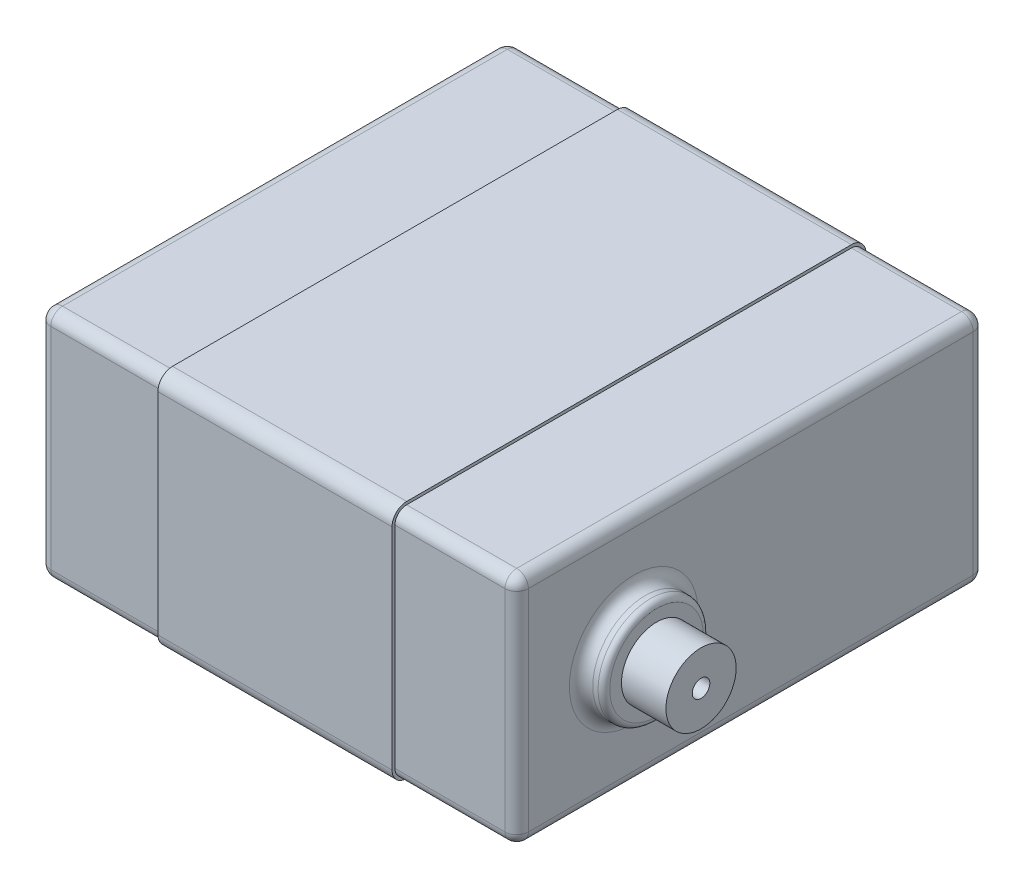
ISO-10303-21;
HEADER;
FILE_DESCRIPTION(('STEP AP214'),'2;1');
FILE_NAME('part.step','',(''),(''),'','','');
FILE_SCHEMA(('AUTOMOTIVE_DESIGN { 1 0 10303 214 1 1 1 1 }'));
ENDSEC;
DATA;
#1=APPLICATION_CONTEXT('core data for automotive mechanical design processes');
#2=APPLICATION_PROTOCOL_DEFINITION('international standard','automotive_design',2000,#1);
#3=PRODUCT_CONTEXT('',#1,'mechanical');
#4=PRODUCT('Part','Part','',(#3));
#5=PRODUCT_RELATED_PRODUCT_CATEGORY('part','',(#4));
#6=PRODUCT_DEFINITION_FORMATION('','',#4);
#7=PRODUCT_DEFINITION_CONTEXT('part definition',#1,'design');
#8=PRODUCT_DEFINITION('design','',#6,#7);
#9=PRODUCT_DEFINITION_SHAPE('','',#8);
#10=(LENGTH_UNIT() NAMED_UNIT(*) SI_UNIT(.MILLI.,.METRE.));
#11=(NAMED_UNIT(*) PLANE_ANGLE_UNIT() SI_UNIT($,.RADIAN.));
#12=(NAMED_UNIT(*) SI_UNIT($,.STERADIAN.) SOLID_ANGLE_UNIT());
#13=UNCERTAINTY_MEASURE_WITH_UNIT(LENGTH_MEASURE(1.E-05),#10,'distance_accuracy_value','');
#14=(GEOMETRIC_REPRESENTATION_CONTEXT(3) GLOBAL_UNCERTAINTY_ASSIGNED_CONTEXT((#13)) GLOBAL_UNIT_ASSIGNED_CONTEXT((#10,
#11,#12)) REPRESENTATION_CONTEXT('',''));
#15=CARTESIAN_POINT('',(0.,0.,0.));
#16=DIRECTION('',(0.,0.,1.));
#17=DIRECTION('',(1.,0.,0.));
#18=AXIS2_PLACEMENT_3D('',#15,#16,#17);
#19=CARTESIAN_POINT('',(-20.4,10.,40.));
#20=DIRECTION('',(0.,-1.,0.));
#21=DIRECTION('',(0.,0.,-1.));
#22=AXIS2_PLACEMENT_3D('',#19,#20,#21);
#23=PLANE('',#22);
#24=DIRECTION('',(-1.,0.,0.));
#25=VECTOR('',#24,1.);
#26=CARTESIAN_POINT('',(-20.4,10.,1.));
#27=LINE('',#26,#25);
#28=CARTESIAN_POINT('',(-10.,10.,1.));
#29=VERTEX_POINT('',#28);
#30=CARTESIAN_POINT('',(-19.4,10.,1.));
#31=VERTEX_POINT('',#30);
#32=EDGE_CURVE('E375',#29,#31,#27,.T.);
#33=ORIENTED_EDGE('',*,*,#32,.T.);
#34=DIRECTION('',(0.,0.,-1.));
#35=VECTOR('',#34,1.);
#36=CARTESIAN_POINT('',(-19.4,10.,40.));
#37=LINE('',#36,#35);
#38=CARTESIAN_POINT('',(-19.4,10.,39.));
#39=VERTEX_POINT('',#38);
#40=EDGE_CURVE('E414',#31,#39,#37,.F.);
#41=ORIENTED_EDGE('',*,*,#40,.T.);
#42=DIRECTION('',(-1.,0.,0.));
#43=VECTOR('',#42,1.);
#44=CARTESIAN_POINT('',(-20.4,10.,39.));
#45=LINE('',#44,#43);
#46=CARTESIAN_POINT('',(-10.,10.,39.));
#47=VERTEX_POINT('',#46);
#48=EDGE_CURVE('E372',#39,#47,#45,.F.);
#49=ORIENTED_EDGE('',*,*,#48,.T.);
#50=DIRECTION('',(0.,0.,1.));
#51=VECTOR('',#50,1.);
#52=CARTESIAN_POINT('',(-10.,10.,40.));
#53=LINE('',#52,#51);
#54=EDGE_CURVE('E264',#29,#47,#53,.T.);
#55=ORIENTED_EDGE('',*,*,#54,.F.);
#56=EDGE_LOOP('',(#33,#41,#49,#55));
#57=FACE_BOUND('',#56,.T.);
#58=ADVANCED_FACE('F43',(#57),#23,.F.);
#59=CARTESIAN_POINT('',(-20.4,-10.,40.));
#60=DIRECTION('',(0.,1.,0.));
#61=DIRECTION('',(0.,0.,1.));
#62=AXIS2_PLACEMENT_3D('',#59,#60,#61);
#63=PLANE('',#62);
#64=DIRECTION('',(1.,0.,0.));
#65=VECTOR('',#64,1.);
#66=CARTESIAN_POINT('',(-20.4,-10.,39.));
#67=LINE('',#66,#65);
#68=CARTESIAN_POINT('',(-10.,-10.,39.));
#69=VERTEX_POINT('',#68);
#70=CARTESIAN_POINT('',(-19.4,-10.,39.));
#71=VERTEX_POINT('',#70);
#72=EDGE_CURVE('E347',#69,#71,#67,.F.);
#73=ORIENTED_EDGE('',*,*,#72,.T.);
#74=DIRECTION('',(0.,0.,-1.));
#75=VECTOR('',#74,1.);
#76=CARTESIAN_POINT('',(-19.4,-10.,40.));
#77=LINE('',#76,#75);
#78=CARTESIAN_POINT('',(-19.4,-10.,1.));
#79=VERTEX_POINT('',#78);
#80=EDGE_CURVE('E426',#71,#79,#77,.T.);
#81=ORIENTED_EDGE('',*,*,#80,.T.);
#82=DIRECTION('',(1.,0.,0.));
#83=VECTOR('',#82,1.);
#84=CARTESIAN_POINT('',(20.4,-10.,1.));
#85=LINE('',#84,#83);
#86=CARTESIAN_POINT('',(-10.,-10.,1.));
#87=VERTEX_POINT('',#86);
#88=EDGE_CURVE('E352',#79,#87,#85,.T.);
#89=ORIENTED_EDGE('',*,*,#88,.T.);
#90=DIRECTION('',(0.,0.,-1.));
#91=VECTOR('',#90,1.);
#92=CARTESIAN_POINT('',(-10.,-10.,40.));
#93=LINE('',#92,#91);
#94=EDGE_CURVE('E285',#69,#87,#93,.T.);
#95=ORIENTED_EDGE('',*,*,#94,.F.);
#96=EDGE_LOOP('',(#73,#81,#89,#95));
#97=FACE_BOUND('',#96,.T.);
#98=ADVANCED_FACE('F555',(#97),#63,.F.);
#99=CARTESIAN_POINT('',(0.,0.,40.));
#100=DIRECTION('',(0.,0.,-1.));
#101=DIRECTION('',(-1.,0.,0.));
#102=AXIS2_PLACEMENT_3D('',#99,#100,#101);
#103=PLANE('',#102);
#104=DIRECTION('',(-1.,0.,0.));
#105=VECTOR('',#104,1.);
#106=CARTESIAN_POINT('',(0.,9.,40.));
#107=LINE('',#106,#105);
#108=CARTESIAN_POINT('',(-10.,9.,40.));
#109=VERTEX_POINT('',#108);
#110=CARTESIAN_POINT('',(-19.4,9.,40.));
#111=VERTEX_POINT('',#110);
#112=EDGE_CURVE('E363',#109,#111,#107,.T.);
#113=ORIENTED_EDGE('',*,*,#112,.T.);
#114=DIRECTION('',(0.,-1.,0.));
#115=VECTOR('',#114,1.);
#116=CARTESIAN_POINT('',(-19.4,0.,40.));
#117=LINE('',#116,#115);
#118=CARTESIAN_POINT('',(-19.4,-9.,40.));
#119=VERTEX_POINT('',#118);
#120=EDGE_CURVE('E420',#111,#119,#117,.T.);
#121=ORIENTED_EDGE('',*,*,#120,.T.);
#122=DIRECTION('',(1.,0.,0.));
#123=VECTOR('',#122,1.);
#124=CARTESIAN_POINT('',(0.,-9.,40.));
#125=LINE('',#124,#123);
#126=CARTESIAN_POINT('',(-10.,-9.,40.));
#127=VERTEX_POINT('',#126);
#128=EDGE_CURVE('E368',#119,#127,#125,.T.);
#129=ORIENTED_EDGE('',*,*,#128,.T.);
#130=DIRECTION('',(0.,-1.,0.));
#131=VECTOR('',#130,1.);
#132=CARTESIAN_POINT('',(-10.,0.,40.));
#133=LINE('',#132,#131);
#134=EDGE_CURVE('E259',#109,#127,#133,.T.);
#135=ORIENTED_EDGE('',*,*,#134,.F.);
#136=EDGE_LOOP('',(#113,#121,#129,#135));
#137=FACE_BOUND('',#136,.T.);
#138=ADVANCED_FACE('F562',(#137),#103,.F.);
#139=CARTESIAN_POINT('',(0.,0.,0.));
#140=DIRECTION('',(0.,0.,-1.));
#141=DIRECTION('',(-1.,0.,0.));
#142=AXIS2_PLACEMENT_3D('',#139,#140,#141);
#143=PLANE('',#142);
#144=DIRECTION('',(1.,0.,0.));
#145=VECTOR('',#144,1.);
#146=CARTESIAN_POINT('',(-20.4,-9.,0.));
#147=LINE('',#146,#145);
#148=CARTESIAN_POINT('',(-10.,-9.,0.));
#149=VERTEX_POINT('',#148);
#150=CARTESIAN_POINT('',(-19.4,-9.,0.));
#151=VERTEX_POINT('',#150);
#152=EDGE_CURVE('E359',#149,#151,#147,.F.);
#153=ORIENTED_EDGE('',*,*,#152,.T.);
#154=DIRECTION('',(0.,-1.,0.));
#155=VECTOR('',#154,1.);
#156=CARTESIAN_POINT('',(-19.4,9.,0.));
#157=LINE('',#156,#155);
#158=CARTESIAN_POINT('',(-19.4,9.,0.));
#159=VERTEX_POINT('',#158);
#160=EDGE_CURVE('E432',#151,#159,#157,.F.);
#161=ORIENTED_EDGE('',*,*,#160,.T.);
#162=DIRECTION('',(-1.,0.,0.));
#163=VECTOR('',#162,1.);
#164=CARTESIAN_POINT('',(20.4,9.,0.));
#165=LINE('',#164,#163);
#166=CARTESIAN_POINT('',(-10.,9.,0.));
#167=VERTEX_POINT('',#166);
#168=EDGE_CURVE('E356',#159,#167,#165,.F.);
#169=ORIENTED_EDGE('',*,*,#168,.T.);
#170=DIRECTION('',(0.,-1.,0.));
#171=VECTOR('',#170,1.);
#172=CARTESIAN_POINT('',(-10.,0.,0.));
#173=LINE('',#172,#171);
#174=EDGE_CURVE('E281',#167,#149,#173,.T.);
#175=ORIENTED_EDGE('',*,*,#174,.T.);
#176=EDGE_LOOP('',(#153,#161,#169,#175));
#177=FACE_BOUND('',#176,.T.);
#178=ADVANCED_FACE('F649',(#177),#143,.T.);
#179=CARTESIAN_POINT('',(-20.4,-9.,1.));
#180=DIRECTION('',(-1.,0.,0.));
#181=DIRECTION('',(0.,0.,1.));
#182=AXIS2_PLACEMENT_3D('',#179,#180,#181);
#183=CYLINDRICAL_SURFACE('',#182,1.);
#184=ORIENTED_EDGE('',*,*,#88,.F.);
#185=CARTESIAN_POINT('',(-19.4,-9.,1.));
#186=DIRECTION('',(-1.,0.,0.));
#187=DIRECTION('',(0.,0.,1.));
#188=AXIS2_PLACEMENT_3D('',#185,#186,#187);
#189=CIRCLE('',#188,1.);
#190=EDGE_CURVE('E429',#79,#151,#189,.F.);
#191=ORIENTED_EDGE('',*,*,#190,.T.);
#192=ORIENTED_EDGE('',*,*,#152,.F.);
#193=CARTESIAN_POINT('',(-10.,-9.,1.));
#194=DIRECTION('',(1.,0.,0.));
#195=DIRECTION('',(0.,0.,-1.));
#196=AXIS2_PLACEMENT_3D('',#193,#194,#195);
#197=CIRCLE('',#196,1.);
#198=EDGE_CURVE('E289',#149,#87,#197,.F.);
#199=ORIENTED_EDGE('',*,*,#198,.T.);
#200=EDGE_LOOP('',(#184,#191,#192,#199));
#201=FACE_BOUND('',#200,.T.);
#202=ADVANCED_FACE('F647',(#201),#183,.T.);
#203=CARTESIAN_POINT('',(0.,-9.,39.));
#204=DIRECTION('',(1.,0.,0.));
#205=DIRECTION('',(0.,0.,-1.));
#206=AXIS2_PLACEMENT_3D('',#203,#204,#205);
#207=CYLINDRICAL_SURFACE('',#206,1.);
#208=ORIENTED_EDGE('',*,*,#128,.F.);
#209=CARTESIAN_POINT('',(-19.4,-9.,39.));
#210=DIRECTION('',(1.,0.,0.));
#211=DIRECTION('',(0.,0.,-1.));
#212=AXIS2_PLACEMENT_3D('',#209,#210,#211);
#213=CIRCLE('',#212,1.);
#214=EDGE_CURVE('E423',#119,#71,#213,.T.);
#215=ORIENTED_EDGE('',*,*,#214,.T.);
#216=ORIENTED_EDGE('',*,*,#72,.F.);
#217=CARTESIAN_POINT('',(-10.,-9.,39.));
#218=DIRECTION('',(1.,0.,0.));
#219=DIRECTION('',(0.,0.,-1.));
#220=AXIS2_PLACEMENT_3D('',#217,#218,#219);
#221=CIRCLE('',#220,1.);
#222=EDGE_CURVE('E277',#69,#127,#221,.F.);
#223=ORIENTED_EDGE('',*,*,#222,.T.);
#224=EDGE_LOOP('',(#208,#215,#216,#223));
#225=FACE_BOUND('',#224,.T.);
#226=ADVANCED_FACE('F826',(#225),#207,.T.);
#227=CARTESIAN_POINT('',(-20.4,9.,1.));
#228=DIRECTION('',(1.,0.,0.));
#229=DIRECTION('',(0.,0.,-1.));
#230=AXIS2_PLACEMENT_3D('',#227,#228,#229);
#231=CYLINDRICAL_SURFACE('',#230,1.);
#232=ORIENTED_EDGE('',*,*,#168,.F.);
#233=CARTESIAN_POINT('',(-19.4,9.,1.));
#234=DIRECTION('',(1.,0.,0.));
#235=DIRECTION('',(0.,0.,-1.));
#236=AXIS2_PLACEMENT_3D('',#233,#234,#235);
#237=CIRCLE('',#236,1.);
#238=EDGE_CURVE('E387',#159,#31,#237,.T.);
#239=ORIENTED_EDGE('',*,*,#238,.T.);
#240=ORIENTED_EDGE('',*,*,#32,.F.);
#241=CARTESIAN_POINT('',(-10.,9.,1.));
#242=DIRECTION('',(1.,0.,0.));
#243=DIRECTION('',(0.,0.,-1.));
#244=AXIS2_PLACEMENT_3D('',#241,#242,#243);
#245=CIRCLE('',#244,1.);
#246=EDGE_CURVE('E273',#29,#167,#245,.F.);
#247=ORIENTED_EDGE('',*,*,#246,.T.);
#248=EDGE_LOOP('',(#232,#239,#240,#247));
#249=FACE_BOUND('',#248,.T.);
#250=ADVANCED_FACE('F662',(#249),#231,.T.);
#251=CARTESIAN_POINT('',(0.,9.,39.));
#252=DIRECTION('',(-1.,0.,0.));
#253=DIRECTION('',(0.,0.,1.));
#254=AXIS2_PLACEMENT_3D('',#251,#252,#253);
#255=CYLINDRICAL_SURFACE('',#254,1.);
#256=ORIENTED_EDGE('',*,*,#48,.F.);
#257=CARTESIAN_POINT('',(-19.4,9.,39.));
#258=DIRECTION('',(-1.,0.,0.));
#259=DIRECTION('',(0.,0.,1.));
#260=AXIS2_PLACEMENT_3D('',#257,#258,#259);
#261=CIRCLE('',#260,1.);
#262=EDGE_CURVE('E417',#39,#111,#261,.F.);
#263=ORIENTED_EDGE('',*,*,#262,.T.);
#264=ORIENTED_EDGE('',*,*,#112,.F.);
#265=CARTESIAN_POINT('',(-10.,9.,39.));
#266=DIRECTION('',(1.,0.,0.));
#267=DIRECTION('',(0.,0.,-1.));
#268=AXIS2_PLACEMENT_3D('',#265,#266,#267);
#269=CIRCLE('',#268,1.);
#270=EDGE_CURVE('E379',#109,#47,#269,.F.);
#271=ORIENTED_EDGE('',*,*,#270,.T.);
#272=EDGE_LOOP('',(#256,#263,#264,#271));
#273=FACE_BOUND('',#272,.T.);
#274=ADVANCED_FACE('F684',(#273),#255,.T.);
#275=CARTESIAN_POINT('',(-20.4,-10.,40.));
#276=DIRECTION('',(1.,0.,0.));
#277=DIRECTION('',(0.,0.,-1.));
#278=AXIS2_PLACEMENT_3D('',#275,#276,#277);
#279=PLANE('',#278);
#280=DIRECTION('',(0.,-1.,0.));
#281=VECTOR('',#280,1.);
#282=CARTESIAN_POINT('',(-20.4,-10.,39.));
#283=LINE('',#282,#281);
#284=CARTESIAN_POINT('',(-20.4,-9.,39.));
#285=VERTEX_POINT('',#284);
#286=CARTESIAN_POINT('',(-20.4,9.,39.));
#287=VERTEX_POINT('',#286);
#288=EDGE_CURVE('E407',#285,#287,#283,.F.);
#289=ORIENTED_EDGE('',*,*,#288,.T.);
#290=DIRECTION('',(0.,0.,-1.));
#291=VECTOR('',#290,1.);
#292=CARTESIAN_POINT('',(-20.4,9.,40.));
#293=LINE('',#292,#291);
#294=CARTESIAN_POINT('',(-20.4,9.,1.));
#295=VERTEX_POINT('',#294);
#296=EDGE_CURVE('E410',#287,#295,#293,.T.);
#297=ORIENTED_EDGE('',*,*,#296,.T.);
#298=DIRECTION('',(0.,-1.,0.));
#299=VECTOR('',#298,1.);
#300=CARTESIAN_POINT('',(-20.4,-9.,1.));
#301=LINE('',#300,#299);
#302=CARTESIAN_POINT('',(-20.4,-9.,1.));
#303=VERTEX_POINT('',#302);
#304=EDGE_CURVE('E401',#295,#303,#301,.T.);
#305=ORIENTED_EDGE('',*,*,#304,.T.);
#306=DIRECTION('',(0.,0.,-1.));
#307=VECTOR('',#306,1.);
#308=CARTESIAN_POINT('',(-20.4,-9.,40.));
#309=LINE('',#308,#307);
#310=EDGE_CURVE('E404',#303,#285,#309,.F.);
#311=ORIENTED_EDGE('',*,*,#310,.T.);
#312=EDGE_LOOP('',(#289,#297,#305,#311));
#313=FACE_BOUND('',#312,.T.);
#314=CARTESIAN_POINT('',(-20.4,0.,30.));
#315=DIRECTION('',(1.,0.,0.));
#316=DIRECTION('',(0.,0.,-1.));
#317=AXIS2_PLACEMENT_3D('',#314,#315,#316);
#318=CIRCLE('',#317,6.57735026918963);
#319=CARTESIAN_POINT('',(-20.4,0.,23.4226497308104));
#320=VERTEX_POINT('',#319);
#321=EDGE_CURVE('E397',#320,#320,#318,.T.);
#322=ORIENTED_EDGE('',*,*,#321,.T.);
#323=EDGE_LOOP('',(#322));
#324=FACE_BOUND('',#323,.T.);
#325=ADVANCED_FACE('F673',(#313,#324),#279,.F.);
#326=CARTESIAN_POINT('',(-20.9,0.,30.));
#327=DIRECTION('',(-1.,0.,0.));
#328=DIRECTION('',(0.,0.,1.));
#329=AXIS2_PLACEMENT_3D('',#326,#327,#328);
#330=PLANE('',#329);
#331=CARTESIAN_POINT('',(-20.9,0.,30.));
#332=DIRECTION('',(-1.,0.,0.));
#333=DIRECTION('',(0.,0.,1.));
#334=AXIS2_PLACEMENT_3D('',#331,#332,#333);
#335=CIRCLE('',#334,5.71132486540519);
#336=CARTESIAN_POINT('',(-20.9,0.,35.7113248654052));
#337=VERTEX_POINT('',#336);
#338=EDGE_CURVE('E324',#337,#337,#335,.T.);
#339=ORIENTED_EDGE('',*,*,#338,.T.);
#340=EDGE_LOOP('',(#339));
#341=FACE_BOUND('',#340,.T.);
#342=CARTESIAN_POINT('',(-20.9,0.,30.));
#343=DIRECTION('',(-1.,0.,0.));
#344=DIRECTION('',(0.,0.,1.));
#345=AXIS2_PLACEMENT_3D('',#342,#343,#344);
#346=CIRCLE('',#345,5.28867513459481);
#347=CARTESIAN_POINT('',(-20.9,0.,35.2886751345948));
#348=VERTEX_POINT('',#347);
#349=EDGE_CURVE('E323',#348,#348,#346,.T.);
#350=ORIENTED_EDGE('',*,*,#349,.F.);
#351=EDGE_LOOP('',(#350));
#352=FACE_BOUND('',#351,.T.);
#353=ADVANCED_FACE('F1109',(#341,#352),#330,.T.);
#354=CARTESIAN_POINT('',(-20.4,0.,30.));
#355=DIRECTION('',(-1.,0.,0.));
#356=DIRECTION('',(0.,0.,1.));
#357=AXIS2_PLACEMENT_3D('',#354,#355,#356);
#358=CONICAL_SURFACE('',#357,5.,0.523598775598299);
#359=ORIENTED_EDGE('',*,*,#349,.T.);
#360=EDGE_LOOP('',(#359));
#361=FACE_BOUND('',#360,.T.);
#362=CARTESIAN_POINT('',(-20.4,0.,30.));
#363=DIRECTION('',(-1.,0.,0.));
#364=DIRECTION('',(0.,0.,1.));
#365=AXIS2_PLACEMENT_3D('',#362,#363,#364);
#366=CIRCLE('',#365,5.);
#367=CARTESIAN_POINT('',(-20.4,0.,35.));
#368=VERTEX_POINT('',#367);
#369=EDGE_CURVE('E319',#368,#368,#366,.T.);
#370=ORIENTED_EDGE('',*,*,#369,.F.);
#371=EDGE_LOOP('',(#370));
#372=FACE_BOUND('',#371,.T.);
#373=ADVANCED_FACE('F1103',(#361,#372),#358,.F.);
#374=CARTESIAN_POINT('',(-25.15,0.,30.));
#375=DIRECTION('',(-1.,0.,0.));
#376=DIRECTION('',(0.,0.,1.));
#377=AXIS2_PLACEMENT_3D('',#374,#375,#376);
#378=PLANE('',#377);
#379=CARTESIAN_POINT('',(-25.15,0.,30.));
#380=DIRECTION('',(-1.,0.,0.));
#381=DIRECTION('',(0.,0.,1.));
#382=AXIS2_PLACEMENT_3D('',#379,#380,#381);
#383=CIRCLE('',#382,0.750000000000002);
#384=CARTESIAN_POINT('',(-25.15,0.,30.75));
#385=VERTEX_POINT('',#384);
#386=EDGE_CURVE('E388',#385,#385,#383,.F.);
#387=ORIENTED_EDGE('',*,*,#386,.T.);
#388=EDGE_LOOP('',(#387));
#389=FACE_BOUND('',#388,.T.);
#390=CARTESIAN_POINT('',(-25.15,0.,30.));
#391=DIRECTION('',(-1.,0.,0.));
#392=DIRECTION('',(0.,0.,1.));
#393=AXIS2_PLACEMENT_3D('',#390,#391,#392);
#394=CIRCLE('',#393,3.);
#395=CARTESIAN_POINT('',(-25.15,0.,33.));
#396=VERTEX_POINT('',#395);
#397=EDGE_CURVE('E328',#396,#396,#394,.T.);
#398=ORIENTED_EDGE('',*,*,#397,.T.);
#399=EDGE_LOOP('',(#398));
#400=FACE_BOUND('',#399,.T.);
#401=ADVANCED_FACE('F1108',(#389,#400),#378,.T.);
#402=CARTESIAN_POINT('',(-25.15,0.,30.));
#403=DIRECTION('',(1.,0.,0.));
#404=DIRECTION('',(0.,0.,-1.));
#405=AXIS2_PLACEMENT_3D('',#402,#403,#404);
#406=CYLINDRICAL_SURFACE('',#405,3.);
#407=ORIENTED_EDGE('',*,*,#397,.F.);
#408=EDGE_LOOP('',(#407));
#409=FACE_BOUND('',#408,.T.);
#410=CARTESIAN_POINT('',(-20.4,0.,30.));
#411=DIRECTION('',(1.,0.,0.));
#412=DIRECTION('',(0.,0.,-1.));
#413=AXIS2_PLACEMENT_3D('',#410,#411,#412);
#414=CIRCLE('',#413,3.);
#415=CARTESIAN_POINT('',(-20.4,0.,27.));
#416=VERTEX_POINT('',#415);
#417=EDGE_CURVE('E340',#416,#416,#414,.F.);
#418=ORIENTED_EDGE('',*,*,#417,.T.);
#419=EDGE_LOOP('',(#418));
#420=FACE_BOUND('',#419,.T.);
#421=ADVANCED_FACE('F1095',(#409,#420),#406,.T.);
#422=ORIENTED_EDGE('',*,*,#417,.F.);
#423=EDGE_LOOP('',(#422));
#424=FACE_BOUND('',#423,.T.);
#425=ORIENTED_EDGE('',*,*,#369,.T.);
#426=EDGE_LOOP('',(#425));
#427=FACE_BOUND('',#426,.T.);
#428=ADVANCED_FACE('F1085',(#424,#427),#279,.F.);
#429=CARTESIAN_POINT('',(10.,-9.,39.));
#430=DIRECTION('',(-1.,0.,0.));
#431=DIRECTION('',(0.,0.,1.));
#432=AXIS2_PLACEMENT_3D('',#429,#430,#431);
#433=CYLINDRICAL_SURFACE('',#432,1.25);
#434=CARTESIAN_POINT('',(-10.,-9.,39.));
#435=DIRECTION('',(1.,0.,0.));
#436=DIRECTION('',(0.,0.,-1.));
#437=AXIS2_PLACEMENT_3D('',#434,#435,#436);
#438=CIRCLE('',#437,1.25);
#439=CARTESIAN_POINT('',(-10.,-9.,40.25));
#440=VERTEX_POINT('',#439);
#441=CARTESIAN_POINT('',(-10.,-10.25,39.));
#442=VERTEX_POINT('',#441);
#443=EDGE_CURVE('E257',#440,#442,#438,.T.);
#444=ORIENTED_EDGE('',*,*,#443,.T.);
#445=DIRECTION('',(-1.,0.,0.));
#446=VECTOR('',#445,1.);
#447=CARTESIAN_POINT('',(10.,-10.25,39.));
#448=LINE('',#447,#446);
#449=CARTESIAN_POINT('',(10.,-10.25,39.));
#450=VERTEX_POINT('',#449);
#451=EDGE_CURVE('E235',#450,#442,#448,.T.);
#452=ORIENTED_EDGE('',*,*,#451,.F.);
#453=CARTESIAN_POINT('',(10.,-9.,39.));
#454=DIRECTION('',(1.,0.,0.));
#455=DIRECTION('',(0.,0.,-1.));
#456=AXIS2_PLACEMENT_3D('',#453,#454,#455);
#457=CIRCLE('',#456,1.25);
#458=CARTESIAN_POINT('',(10.,-9.,40.25));
#459=VERTEX_POINT('',#458);
#460=EDGE_CURVE('E243',#459,#450,#457,.T.);
#461=ORIENTED_EDGE('',*,*,#460,.F.);
#462=DIRECTION('',(-1.,0.,0.));
#463=VECTOR('',#462,1.);
#464=CARTESIAN_POINT('',(10.,-9.,40.25));
#465=LINE('',#464,#463);
#466=EDGE_CURVE('E1187',#459,#440,#465,.T.);
#467=ORIENTED_EDGE('',*,*,#466,.T.);
#468=EDGE_LOOP('',(#444,#452,#461,#467));
#469=FACE_BOUND('',#468,.T.);
#470=ADVANCED_FACE('F255',(#469),#433,.T.);
#471=CARTESIAN_POINT('',(10.,-10.25,39.));
#472=DIRECTION('',(0.,1.,0.));
#473=DIRECTION('',(0.,0.,1.));
#474=AXIS2_PLACEMENT_3D('',#471,#472,#473);
#475=PLANE('',#474);
#476=DIRECTION('',(0.,0.,-1.));
#477=VECTOR('',#476,1.);
#478=CARTESIAN_POINT('',(-10.,-10.25,39.));
#479=LINE('',#478,#477);
#480=CARTESIAN_POINT('',(-10.,-10.25,1.));
#481=VERTEX_POINT('',#480);
#482=EDGE_CURVE('E1158',#442,#481,#479,.T.);
#483=ORIENTED_EDGE('',*,*,#482,.T.);
#484=DIRECTION('',(-1.,0.,0.));
#485=VECTOR('',#484,1.);
#486=CARTESIAN_POINT('',(10.,-10.25,1.));
#487=LINE('',#486,#485);
#488=CARTESIAN_POINT('',(10.,-10.25,1.));
#489=VERTEX_POINT('',#488);
#490=EDGE_CURVE('E238',#489,#481,#487,.T.);
#491=ORIENTED_EDGE('',*,*,#490,.F.);
#492=DIRECTION('',(0.,0.,-1.));
#493=VECTOR('',#492,1.);
#494=CARTESIAN_POINT('',(10.,-10.25,39.));
#495=LINE('',#494,#493);
#496=EDGE_CURVE('E231',#450,#489,#495,.T.);
#497=ORIENTED_EDGE('',*,*,#496,.F.);
#498=ORIENTED_EDGE('',*,*,#451,.T.);
#499=EDGE_LOOP('',(#483,#491,#497,#498));
#500=FACE_BOUND('',#499,.T.);
#501=ADVANCED_FACE('F233',(#500),#475,.F.);
#502=CARTESIAN_POINT('',(10.,-9.,1.));
#503=DIRECTION('',(-1.,0.,0.));
#504=DIRECTION('',(0.,0.,1.));
#505=AXIS2_PLACEMENT_3D('',#502,#503,#504);
#506=CYLINDRICAL_SURFACE('',#505,1.25);
#507=CARTESIAN_POINT('',(-10.,-9.,1.));
#508=DIRECTION('',(1.,0.,0.));
#509=DIRECTION('',(0.,0.,-1.));
#510=AXIS2_PLACEMENT_3D('',#507,#508,#509);
#511=CIRCLE('',#510,1.25);
#512=CARTESIAN_POINT('',(-10.,-9.,-0.249999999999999));
#513=VERTEX_POINT('',#512);
#514=EDGE_CURVE('E1164',#481,#513,#511,.T.);
#515=ORIENTED_EDGE('',*,*,#514,.T.);
#516=DIRECTION('',(-1.,0.,0.));
#517=VECTOR('',#516,1.);
#518=CARTESIAN_POINT('',(10.,-9.,-0.249999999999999));
#519=LINE('',#518,#517);
#520=CARTESIAN_POINT('',(10.,-9.,-0.249999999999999));
#521=VERTEX_POINT('',#520);
#522=EDGE_CURVE('E266',#521,#513,#519,.T.);
#523=ORIENTED_EDGE('',*,*,#522,.F.);
#524=CARTESIAN_POINT('',(10.,-9.,1.));
#525=DIRECTION('',(1.,0.,0.));
#526=DIRECTION('',(0.,0.,-1.));
#527=AXIS2_PLACEMENT_3D('',#524,#525,#526);
#528=CIRCLE('',#527,1.25);
#529=EDGE_CURVE('E242',#489,#521,#528,.T.);
#530=ORIENTED_EDGE('',*,*,#529,.F.);
#531=ORIENTED_EDGE('',*,*,#490,.T.);
#532=EDGE_LOOP('',(#515,#523,#530,#531));
#533=FACE_BOUND('',#532,.T.);
#534=ADVANCED_FACE('F1055',(#533),#506,.T.);
#535=CARTESIAN_POINT('',(10.,-9.,-0.249999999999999));
#536=DIRECTION('',(0.,0.,1.));
#537=DIRECTION('',(0.,-1.,0.));
#538=AXIS2_PLACEMENT_3D('',#535,#536,#537);
#539=PLANE('',#538);
#540=DIRECTION('',(0.,1.,0.));
#541=VECTOR('',#540,1.);
#542=CARTESIAN_POINT('',(-10.,-9.,-0.249999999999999));
#543=LINE('',#542,#541);
#544=CARTESIAN_POINT('',(-10.,9.,-0.25));
#545=VERTEX_POINT('',#544);
#546=EDGE_CURVE('E1173',#513,#545,#543,.T.);
#547=ORIENTED_EDGE('',*,*,#546,.T.);
#548=DIRECTION('',(-1.,0.,0.));
#549=VECTOR('',#548,1.);
#550=CARTESIAN_POINT('',(10.,9.,-0.25));
#551=LINE('',#550,#549);
#552=CARTESIAN_POINT('',(10.,9.,-0.25));
#553=VERTEX_POINT('',#552);
#554=EDGE_CURVE('E1202',#553,#545,#551,.T.);
#555=ORIENTED_EDGE('',*,*,#554,.F.);
#556=DIRECTION('',(0.,1.,0.));
#557=VECTOR('',#556,1.);
#558=CARTESIAN_POINT('',(10.,-9.,-0.249999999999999));
#559=LINE('',#558,#557);
#560=EDGE_CURVE('E1211',#521,#553,#559,.T.);
#561=ORIENTED_EDGE('',*,*,#560,.F.);
#562=ORIENTED_EDGE('',*,*,#522,.T.);
#563=EDGE_LOOP('',(#547,#555,#561,#562));
#564=FACE_BOUND('',#563,.T.);
#565=ADVANCED_FACE('F1044',(#564),#539,.F.);
#566=CARTESIAN_POINT('',(10.,9.,1.));
#567=DIRECTION('',(-1.,0.,0.));
#568=DIRECTION('',(0.,0.,1.));
#569=AXIS2_PLACEMENT_3D('',#566,#567,#568);
#570=CYLINDRICAL_SURFACE('',#569,1.25);
#571=CARTESIAN_POINT('',(-10.,9.,1.));
#572=DIRECTION('',(1.,0.,0.));
#573=DIRECTION('',(0.,0.,-1.));
#574=AXIS2_PLACEMENT_3D('',#571,#572,#573);
#575=CIRCLE('',#574,1.25);
#576=CARTESIAN_POINT('',(-10.,10.25,1.));
#577=VERTEX_POINT('',#576);
#578=EDGE_CURVE('E1176',#545,#577,#575,.T.);
#579=ORIENTED_EDGE('',*,*,#578,.T.);
#580=DIRECTION('',(-1.,0.,0.));
#581=VECTOR('',#580,1.);
#582=CARTESIAN_POINT('',(10.,10.25,1.));
#583=LINE('',#582,#581);
#584=CARTESIAN_POINT('',(10.,10.25,1.));
#585=VERTEX_POINT('',#584);
#586=EDGE_CURVE('E1198',#585,#577,#583,.T.);
#587=ORIENTED_EDGE('',*,*,#586,.F.);
#588=CARTESIAN_POINT('',(10.,9.,1.));
#589=DIRECTION('',(1.,0.,0.));
#590=DIRECTION('',(0.,0.,-1.));
#591=AXIS2_PLACEMENT_3D('',#588,#589,#590);
#592=CIRCLE('',#591,1.25);
#593=EDGE_CURVE('E1222',#553,#585,#592,.T.);
#594=ORIENTED_EDGE('',*,*,#593,.F.);
#595=ORIENTED_EDGE('',*,*,#554,.T.);
#596=EDGE_LOOP('',(#579,#587,#594,#595));
#597=FACE_BOUND('',#596,.T.);
#598=ADVANCED_FACE('F1033',(#597),#570,.T.);
#599=CARTESIAN_POINT('',(10.,10.25,1.));
#600=DIRECTION('',(0.,-1.,0.));
#601=DIRECTION('',(0.,0.,-1.));
#602=AXIS2_PLACEMENT_3D('',#599,#600,#601);
#603=PLANE('',#602);
#604=DIRECTION('',(0.,0.,1.));
#605=VECTOR('',#604,1.);
#606=CARTESIAN_POINT('',(-10.,10.25,1.));
#607=LINE('',#606,#605);
#608=CARTESIAN_POINT('',(-10.,10.25,39.));
#609=VERTEX_POINT('',#608);
#610=EDGE_CURVE('E1179',#577,#609,#607,.T.);
#611=ORIENTED_EDGE('',*,*,#610,.T.);
#612=DIRECTION('',(-1.,0.,0.));
#613=VECTOR('',#612,1.);
#614=CARTESIAN_POINT('',(10.,10.25,39.));
#615=LINE('',#614,#613);
#616=CARTESIAN_POINT('',(10.,10.25,39.));
#617=VERTEX_POINT('',#616);
#618=EDGE_CURVE('E1194',#617,#609,#615,.T.);
#619=ORIENTED_EDGE('',*,*,#618,.F.);
#620=DIRECTION('',(0.,0.,1.));
#621=VECTOR('',#620,1.);
#622=CARTESIAN_POINT('',(10.,10.25,1.));
#623=LINE('',#622,#621);
#624=EDGE_CURVE('E1218',#585,#617,#623,.T.);
#625=ORIENTED_EDGE('',*,*,#624,.F.);
#626=ORIENTED_EDGE('',*,*,#586,.T.);
#627=EDGE_LOOP('',(#611,#619,#625,#626));
#628=FACE_BOUND('',#627,.T.);
#629=ADVANCED_FACE('F1023',(#628),#603,.F.);
#630=CARTESIAN_POINT('',(10.,9.,39.));
#631=DIRECTION('',(-1.,0.,0.));
#632=DIRECTION('',(0.,0.,1.));
#633=AXIS2_PLACEMENT_3D('',#630,#631,#632);
#634=CYLINDRICAL_SURFACE('',#633,1.25);
#635=CARTESIAN_POINT('',(-10.,9.,39.));
#636=DIRECTION('',(1.,0.,0.));
#637=DIRECTION('',(0.,0.,-1.));
#638=AXIS2_PLACEMENT_3D('',#635,#636,#637);
#639=CIRCLE('',#638,1.25);
#640=CARTESIAN_POINT('',(-10.,9.,40.25));
#641=VERTEX_POINT('',#640);
#642=EDGE_CURVE('E1182',#609,#641,#639,.T.);
#643=ORIENTED_EDGE('',*,*,#642,.T.);
#644=DIRECTION('',(-1.,0.,0.));
#645=VECTOR('',#644,1.);
#646=CARTESIAN_POINT('',(10.,9.,40.25));
#647=LINE('',#646,#645);
#648=CARTESIAN_POINT('',(10.,9.,40.25));
#649=VERTEX_POINT('',#648);
#650=EDGE_CURVE('E1190',#649,#641,#647,.T.);
#651=ORIENTED_EDGE('',*,*,#650,.F.);
#652=CARTESIAN_POINT('',(10.,9.,39.));
#653=DIRECTION('',(1.,0.,0.));
#654=DIRECTION('',(0.,0.,-1.));
#655=AXIS2_PLACEMENT_3D('',#652,#653,#654);
#656=CIRCLE('',#655,1.25);
#657=EDGE_CURVE('E1221',#617,#649,#656,.T.);
#658=ORIENTED_EDGE('',*,*,#657,.F.);
#659=ORIENTED_EDGE('',*,*,#618,.T.);
#660=EDGE_LOOP('',(#643,#651,#658,#659));
#661=FACE_BOUND('',#660,.T.);
#662=ADVANCED_FACE('F1012',(#661),#634,.T.);
#663=CARTESIAN_POINT('',(10.,9.,40.25));
#664=DIRECTION('',(0.,0.,-1.));
#665=DIRECTION('',(-1.,0.,0.));
#666=AXIS2_PLACEMENT_3D('',#663,#664,#665);
#667=PLANE('',#666);
#668=DIRECTION('',(0.,-1.,0.));
#669=VECTOR('',#668,1.);
#670=CARTESIAN_POINT('',(-10.,9.,40.25));
#671=LINE('',#670,#669);
#672=EDGE_CURVE('E253',#641,#440,#671,.T.);
#673=ORIENTED_EDGE('',*,*,#672,.T.);
#674=ORIENTED_EDGE('',*,*,#466,.F.);
#675=DIRECTION('',(0.,-1.,0.));
#676=VECTOR('',#675,1.);
#677=CARTESIAN_POINT('',(10.,9.,40.25));
#678=LINE('',#677,#676);
#679=EDGE_CURVE('E248',#649,#459,#678,.T.);
#680=ORIENTED_EDGE('',*,*,#679,.F.);
#681=ORIENTED_EDGE('',*,*,#650,.T.);
#682=EDGE_LOOP('',(#673,#674,#680,#681));
#683=FACE_BOUND('',#682,.T.);
#684=ADVANCED_FACE('F1000',(#683),#667,.F.);
#685=CARTESIAN_POINT('',(10.,-9.,39.));
#686=DIRECTION('',(1.,0.,0.));
#687=DIRECTION('',(0.,0.,-1.));
#688=AXIS2_PLACEMENT_3D('',#685,#686,#687);
#689=PLANE('',#688);
#690=DIRECTION('',(0.,-1.,0.));
#691=VECTOR('',#690,1.);
#692=CARTESIAN_POINT('',(10.,0.,0.));
#693=LINE('',#692,#691);
#694=CARTESIAN_POINT('',(10.,9.,0.));
#695=VERTEX_POINT('',#694);
#696=CARTESIAN_POINT('',(10.,-9.,0.));
#697=VERTEX_POINT('',#696);
#698=EDGE_CURVE('E308',#695,#697,#693,.T.);
#699=ORIENTED_EDGE('',*,*,#698,.T.);
#700=CARTESIAN_POINT('',(10.,-9.,1.));
#701=DIRECTION('',(1.,0.,0.));
#702=DIRECTION('',(0.,0.,-1.));
#703=AXIS2_PLACEMENT_3D('',#700,#701,#702);
#704=CIRCLE('',#703,1.);
#705=CARTESIAN_POINT('',(10.,-10.,1.));
#706=VERTEX_POINT('',#705);
#707=EDGE_CURVE('E315',#697,#706,#704,.F.);
#708=ORIENTED_EDGE('',*,*,#707,.T.);
#709=DIRECTION('',(0.,0.,-1.));
#710=VECTOR('',#709,1.);
#711=CARTESIAN_POINT('',(10.,-10.,40.));
#712=LINE('',#711,#710);
#713=CARTESIAN_POINT('',(10.,-10.,39.));
#714=VERTEX_POINT('',#713);
#715=EDGE_CURVE('E312',#714,#706,#712,.T.);
#716=ORIENTED_EDGE('',*,*,#715,.F.);
#717=CARTESIAN_POINT('',(10.,-9.,39.));
#718=DIRECTION('',(1.,0.,0.));
#719=DIRECTION('',(0.,0.,-1.));
#720=AXIS2_PLACEMENT_3D('',#717,#718,#719);
#721=CIRCLE('',#720,1.);
#722=CARTESIAN_POINT('',(10.,-9.,40.));
#723=VERTEX_POINT('',#722);
#724=EDGE_CURVE('E304',#714,#723,#721,.F.);
#725=ORIENTED_EDGE('',*,*,#724,.T.);
#726=DIRECTION('',(0.,-1.,0.));
#727=VECTOR('',#726,1.);
#728=CARTESIAN_POINT('',(10.,0.,40.));
#729=LINE('',#728,#727);
#730=CARTESIAN_POINT('',(10.,9.,40.));
#731=VERTEX_POINT('',#730);
#732=EDGE_CURVE('E293',#731,#723,#729,.T.);
#733=ORIENTED_EDGE('',*,*,#732,.F.);
#734=CARTESIAN_POINT('',(10.,9.,39.));
#735=DIRECTION('',(1.,0.,0.));
#736=DIRECTION('',(0.,0.,-1.));
#737=AXIS2_PLACEMENT_3D('',#734,#735,#736);
#738=CIRCLE('',#737,1.);
#739=CARTESIAN_POINT('',(10.,10.,39.));
#740=VERTEX_POINT('',#739);
#741=EDGE_CURVE('E383',#731,#740,#738,.F.);
#742=ORIENTED_EDGE('',*,*,#741,.T.);
#743=DIRECTION('',(0.,0.,1.));
#744=VECTOR('',#743,1.);
#745=CARTESIAN_POINT('',(10.,10.,40.));
#746=LINE('',#745,#744);
#747=CARTESIAN_POINT('',(10.,10.,1.));
#748=VERTEX_POINT('',#747);
#749=EDGE_CURVE('E296',#748,#740,#746,.T.);
#750=ORIENTED_EDGE('',*,*,#749,.F.);
#751=CARTESIAN_POINT('',(10.,9.,1.));
#752=DIRECTION('',(1.,0.,0.));
#753=DIRECTION('',(0.,0.,-1.));
#754=AXIS2_PLACEMENT_3D('',#751,#752,#753);
#755=CIRCLE('',#754,1.);
#756=EDGE_CURVE('E300',#748,#695,#755,.F.);
#757=ORIENTED_EDGE('',*,*,#756,.T.);
#758=EDGE_LOOP('',(#699,#708,#716,#725,#733,#742,#750,#757));
#759=FACE_BOUND('',#758,.T.);
#760=ORIENTED_EDGE('',*,*,#460,.T.);
#761=ORIENTED_EDGE('',*,*,#496,.T.);
#762=ORIENTED_EDGE('',*,*,#529,.T.);
#763=ORIENTED_EDGE('',*,*,#560,.T.);
#764=ORIENTED_EDGE('',*,*,#593,.T.);
#765=ORIENTED_EDGE('',*,*,#624,.T.);
#766=ORIENTED_EDGE('',*,*,#657,.T.);
#767=ORIENTED_EDGE('',*,*,#679,.T.);
#768=EDGE_LOOP('',(#760,#761,#762,#763,#764,#765,#766,#767));
#769=FACE_BOUND('',#768,.T.);
#770=ADVANCED_FACE('F246',(#759,#769),#689,.T.);
#771=CARTESIAN_POINT('',(-10.,-9.,39.));
#772=DIRECTION('',(1.,0.,0.));
#773=DIRECTION('',(0.,0.,-1.));
#774=AXIS2_PLACEMENT_3D('',#771,#772,#773);
#775=PLANE('',#774);
#776=ORIENTED_EDGE('',*,*,#198,.F.);
#777=ORIENTED_EDGE('',*,*,#174,.F.);
#778=ORIENTED_EDGE('',*,*,#246,.F.);
#779=ORIENTED_EDGE('',*,*,#54,.T.);
#780=ORIENTED_EDGE('',*,*,#270,.F.);
#781=ORIENTED_EDGE('',*,*,#134,.T.);
#782=ORIENTED_EDGE('',*,*,#222,.F.);
#783=ORIENTED_EDGE('',*,*,#94,.T.);
#784=EDGE_LOOP('',(#776,#777,#778,#779,#780,#781,#782,#783));
#785=FACE_BOUND('',#784,.T.);
#786=ORIENTED_EDGE('',*,*,#443,.F.);
#787=ORIENTED_EDGE('',*,*,#672,.F.);
#788=ORIENTED_EDGE('',*,*,#642,.F.);
#789=ORIENTED_EDGE('',*,*,#610,.F.);
#790=ORIENTED_EDGE('',*,*,#578,.F.);
#791=ORIENTED_EDGE('',*,*,#546,.F.);
#792=ORIENTED_EDGE('',*,*,#514,.F.);
#793=ORIENTED_EDGE('',*,*,#482,.F.);
#794=EDGE_LOOP('',(#786,#787,#788,#789,#790,#791,#792,#793));
#795=FACE_BOUND('',#794,.T.);
#796=ADVANCED_FACE('F978',(#785,#795),#775,.F.);
#797=CARTESIAN_POINT('',(26.15,0.,30.));
#798=DIRECTION('',(1.,0.,0.));
#799=DIRECTION('',(0.,0.,-1.));
#800=AXIS2_PLACEMENT_3D('',#797,#798,#799);
#801=PLANE('',#800);
#802=CARTESIAN_POINT('',(26.15,0.,30.));
#803=DIRECTION('',(1.,0.,0.));
#804=DIRECTION('',(0.,0.,-1.));
#805=AXIS2_PLACEMENT_3D('',#802,#803,#804);
#806=CIRCLE('',#805,0.750000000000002);
#807=CARTESIAN_POINT('',(26.15,0.,29.25));
#808=VERTEX_POINT('',#807);
#809=EDGE_CURVE('E392',#808,#808,#806,.T.);
#810=ORIENTED_EDGE('',*,*,#809,.F.);
#811=EDGE_LOOP('',(#810));
#812=FACE_BOUND('',#811,.T.);
#813=CARTESIAN_POINT('',(26.15,0.,30.));
#814=DIRECTION('',(1.,0.,0.));
#815=DIRECTION('',(0.,0.,-1.));
#816=AXIS2_PLACEMENT_3D('',#813,#814,#815);
#817=CIRCLE('',#816,3.);
#818=CARTESIAN_POINT('',(26.15,0.,27.));
#819=VERTEX_POINT('',#818);
#820=EDGE_CURVE('E336',#819,#819,#817,.T.);
#821=ORIENTED_EDGE('',*,*,#820,.T.);
#822=EDGE_LOOP('',(#821));
#823=FACE_BOUND('',#822,.T.);
#824=ADVANCED_FACE('F974',(#812,#823),#801,.T.);
#825=CARTESIAN_POINT('',(26.15,0.,30.));
#826=DIRECTION('',(-1.,0.,0.));
#827=DIRECTION('',(0.,0.,1.));
#828=AXIS2_PLACEMENT_3D('',#825,#826,#827);
#829=CYLINDRICAL_SURFACE('',#828,3.);
#830=CARTESIAN_POINT('',(22.35,0.,30.));
#831=DIRECTION('',(1.,0.,0.));
#832=DIRECTION('',(0.,0.,-1.));
#833=AXIS2_PLACEMENT_3D('',#830,#831,#832);
#834=CIRCLE('',#833,3.);
#835=CARTESIAN_POINT('',(22.35,0.,27.));
#836=VERTEX_POINT('',#835);
#837=EDGE_CURVE('E335',#836,#836,#834,.T.);
#838=ORIENTED_EDGE('',*,*,#837,.T.);
#839=EDGE_LOOP('',(#838));
#840=FACE_BOUND('',#839,.T.);
#841=ORIENTED_EDGE('',*,*,#820,.F.);
#842=EDGE_LOOP('',(#841));
#843=FACE_BOUND('',#842,.T.);
#844=ADVANCED_FACE('F774',(#840,#843),#829,.T.);
#845=CARTESIAN_POINT('',(22.35,0.,30.));
#846=DIRECTION('',(1.,0.,0.));
#847=DIRECTION('',(0.,0.,-1.));
#848=AXIS2_PLACEMENT_3D('',#845,#846,#847);
#849=PLANE('',#848);
#850=CARTESIAN_POINT('',(22.35,0.,30.));
#851=DIRECTION('',(1.,0.,0.));
#852=DIRECTION('',(0.,0.,-1.));
#853=AXIS2_PLACEMENT_3D('',#850,#851,#852);
#854=CIRCLE('',#853,4.);
#855=CARTESIAN_POINT('',(22.35,0.,26.));
#856=VERTEX_POINT('',#855);
#857=EDGE_CURVE('E52',#856,#856,#854,.T.);
#858=ORIENTED_EDGE('',*,*,#857,.T.);
#859=EDGE_LOOP('',(#858));
#860=FACE_BOUND('',#859,.T.);
#861=ORIENTED_EDGE('',*,*,#837,.F.);
#862=EDGE_LOOP('',(#861));
#863=FACE_BOUND('',#862,.T.);
#864=ADVANCED_FACE('F542',(#860,#863),#849,.T.);
#865=CARTESIAN_POINT('',(22.35,0.,30.));
#866=DIRECTION('',(-1.,0.,0.));
#867=DIRECTION('',(0.,0.,1.));
#868=AXIS2_PLACEMENT_3D('',#865,#866,#867);
#869=CYLINDRICAL_SURFACE('',#868,4.5);
#870=CARTESIAN_POINT('',(21.85,0.,30.));
#871=DIRECTION('',(1.,0.,0.));
#872=DIRECTION('',(0.,0.,-1.));
#873=AXIS2_PLACEMENT_3D('',#870,#871,#872);
#874=CIRCLE('',#873,4.5);
#875=CARTESIAN_POINT('',(21.85,0.,25.5));
#876=VERTEX_POINT('',#875);
#877=EDGE_CURVE('E11',#876,#876,#874,.F.);
#878=ORIENTED_EDGE('',*,*,#877,.T.);
#879=EDGE_LOOP('',(#878));
#880=FACE_BOUND('',#879,.T.);
#881=CARTESIAN_POINT('',(21.4,0.,30.));
#882=DIRECTION('',(-1.,0.,0.));
#883=DIRECTION('',(0.,0.,1.));
#884=AXIS2_PLACEMENT_3D('',#881,#882,#883);
#885=CIRCLE('',#884,4.5);
#886=CARTESIAN_POINT('',(21.4,0.,34.5));
#887=VERTEX_POINT('',#886);
#888=EDGE_CURVE('E475',#887,#887,#885,.F.);
#889=ORIENTED_EDGE('',*,*,#888,.T.);
#890=EDGE_LOOP('',(#889));
#891=FACE_BOUND('',#890,.T.);
#892=ADVANCED_FACE('F773',(#880,#891),#869,.T.);
#893=CARTESIAN_POINT('',(20.4,-10.,40.));
#894=DIRECTION('',(-1.,0.,0.));
#895=DIRECTION('',(0.,0.,1.));
#896=AXIS2_PLACEMENT_3D('',#893,#894,#895);
#897=PLANE('',#896);
#898=DIRECTION('',(0.,0.,-1.));
#899=VECTOR('',#898,1.);
#900=CARTESIAN_POINT('',(20.4,9.,40.));
#901=LINE('',#900,#899);
#902=CARTESIAN_POINT('',(20.4,9.,1.));
#903=VERTEX_POINT('',#902);
#904=CARTESIAN_POINT('',(20.4,9.,39.));
#905=VERTEX_POINT('',#904);
#906=EDGE_CURVE('E452',#903,#905,#901,.F.);
#907=ORIENTED_EDGE('',*,*,#906,.T.);
#908=DIRECTION('',(0.,1.,0.));
#909=VECTOR('',#908,1.);
#910=CARTESIAN_POINT('',(20.4,-10.,39.));
#911=LINE('',#910,#909);
#912=CARTESIAN_POINT('',(20.4,-9.,39.));
#913=VERTEX_POINT('',#912);
#914=EDGE_CURVE('E455',#905,#913,#911,.F.);
#915=ORIENTED_EDGE('',*,*,#914,.T.);
#916=DIRECTION('',(0.,0.,-1.));
#917=VECTOR('',#916,1.);
#918=CARTESIAN_POINT('',(20.4,-9.,40.));
#919=LINE('',#918,#917);
#920=CARTESIAN_POINT('',(20.4,-9.,1.));
#921=VERTEX_POINT('',#920);
#922=EDGE_CURVE('E446',#913,#921,#919,.T.);
#923=ORIENTED_EDGE('',*,*,#922,.T.);
#924=DIRECTION('',(0.,1.,0.));
#925=VECTOR('',#924,1.);
#926=CARTESIAN_POINT('',(20.4,9.,1.));
#927=LINE('',#926,#925);
#928=EDGE_CURVE('E449',#921,#903,#927,.T.);
#929=ORIENTED_EDGE('',*,*,#928,.T.);
#930=EDGE_LOOP('',(#907,#915,#923,#929));
#931=FACE_BOUND('',#930,.T.);
#932=CARTESIAN_POINT('',(20.4,0.,30.));
#933=DIRECTION('',(-1.,0.,0.));
#934=DIRECTION('',(0.,0.,1.));
#935=AXIS2_PLACEMENT_3D('',#932,#933,#934);
#936=CIRCLE('',#935,5.5);
#937=CARTESIAN_POINT('',(20.4,0.,35.5));
#938=VERTEX_POINT('',#937);
#939=EDGE_CURVE('E442',#938,#938,#936,.T.);
#940=ORIENTED_EDGE('',*,*,#939,.T.);
#941=EDGE_LOOP('',(#940));
#942=FACE_BOUND('',#941,.T.);
#943=ADVANCED_FACE('F604',(#931,#942),#897,.F.);
#944=CARTESIAN_POINT('',(19.4,-9.,0.));
#945=VERTEX_POINT('',#944);
#946=EDGE_CURVE('E360',#945,#697,#147,.F.);
#947=ORIENTED_EDGE('',*,*,#946,.F.);
#948=CARTESIAN_POINT('',(19.4,-9.,1.));
#949=DIRECTION('',(-1.,0.,0.));
#950=DIRECTION('',(0.,0.,1.));
#951=AXIS2_PLACEMENT_3D('',#948,#949,#950);
#952=CIRCLE('',#951,1.);
#953=CARTESIAN_POINT('',(19.4,-10.,1.));
#954=VERTEX_POINT('',#953);
#955=EDGE_CURVE('E59',#945,#954,#952,.T.);
#956=ORIENTED_EDGE('',*,*,#955,.T.);
#957=EDGE_CURVE('E351',#706,#954,#85,.T.);
#958=ORIENTED_EDGE('',*,*,#957,.F.);
#959=ORIENTED_EDGE('',*,*,#707,.F.);
#960=EDGE_LOOP('',(#947,#956,#958,#959));
#961=FACE_BOUND('',#960,.T.);
#962=ADVANCED_FACE('F797',(#961),#183,.T.);
#963=CARTESIAN_POINT('',(19.4,10.,1.));
#964=VERTEX_POINT('',#963);
#965=EDGE_CURVE('E376',#964,#748,#27,.T.);
#966=ORIENTED_EDGE('',*,*,#965,.F.);
#967=CARTESIAN_POINT('',(19.4,9.,1.));
#968=DIRECTION('',(1.,0.,0.));
#969=DIRECTION('',(0.,0.,-1.));
#970=AXIS2_PLACEMENT_3D('',#967,#968,#969);
#971=CIRCLE('',#970,1.);
#972=CARTESIAN_POINT('',(19.4,9.,0.));
#973=VERTEX_POINT('',#972);
#974=EDGE_CURVE('E465',#964,#973,#971,.F.);
#975=ORIENTED_EDGE('',*,*,#974,.T.);
#976=EDGE_CURVE('E355',#695,#973,#165,.F.);
#977=ORIENTED_EDGE('',*,*,#976,.F.);
#978=ORIENTED_EDGE('',*,*,#756,.F.);
#979=EDGE_LOOP('',(#966,#975,#977,#978));
#980=FACE_BOUND('',#979,.T.);
#981=ADVANCED_FACE('F616',(#980),#231,.T.);
#982=ORIENTED_EDGE('',*,*,#976,.T.);
#983=DIRECTION('',(0.,1.,0.));
#984=VECTOR('',#983,1.);
#985=CARTESIAN_POINT('',(19.4,-9.,0.));
#986=LINE('',#985,#984);
#987=EDGE_CURVE('E67',#973,#945,#986,.F.);
#988=ORIENTED_EDGE('',*,*,#987,.T.);
#989=ORIENTED_EDGE('',*,*,#946,.T.);
#990=ORIENTED_EDGE('',*,*,#698,.F.);
#991=EDGE_LOOP('',(#982,#988,#989,#990));
#992=FACE_BOUND('',#991,.T.);
#993=ADVANCED_FACE('F618',(#992),#143,.T.);
#994=CARTESIAN_POINT('',(19.4,-10.,39.));
#995=VERTEX_POINT('',#994);
#996=EDGE_CURVE('E348',#995,#714,#67,.F.);
#997=ORIENTED_EDGE('',*,*,#996,.F.);
#998=CARTESIAN_POINT('',(19.4,-9.,39.));
#999=DIRECTION('',(1.,0.,0.));
#1000=DIRECTION('',(0.,0.,-1.));
#1001=AXIS2_PLACEMENT_3D('',#998,#999,#1000);
#1002=CIRCLE('',#1001,1.);
#1003=CARTESIAN_POINT('',(19.4,-9.,40.));
#1004=VERTEX_POINT('',#1003);
#1005=EDGE_CURVE('E435',#995,#1004,#1002,.F.);
#1006=ORIENTED_EDGE('',*,*,#1005,.T.);
#1007=EDGE_CURVE('E367',#723,#1004,#125,.T.);
#1008=ORIENTED_EDGE('',*,*,#1007,.F.);
#1009=ORIENTED_EDGE('',*,*,#724,.F.);
#1010=EDGE_LOOP('',(#997,#1006,#1008,#1009));
#1011=FACE_BOUND('',#1010,.T.);
#1012=ADVANCED_FACE('F816',(#1011),#207,.T.);
#1013=CARTESIAN_POINT('',(19.4,9.,40.));
#1014=VERTEX_POINT('',#1013);
#1015=EDGE_CURVE('E364',#1014,#731,#107,.T.);
#1016=ORIENTED_EDGE('',*,*,#1015,.F.);
#1017=CARTESIAN_POINT('',(19.4,9.,39.));
#1018=DIRECTION('',(-1.,0.,0.));
#1019=DIRECTION('',(0.,0.,1.));
#1020=AXIS2_PLACEMENT_3D('',#1017,#1018,#1019);
#1021=CIRCLE('',#1020,1.);
#1022=CARTESIAN_POINT('',(19.4,10.,39.));
#1023=VERTEX_POINT('',#1022);
#1024=EDGE_CURVE('E459',#1014,#1023,#1021,.T.);
#1025=ORIENTED_EDGE('',*,*,#1024,.T.);
#1026=EDGE_CURVE('E371',#740,#1023,#45,.F.);
#1027=ORIENTED_EDGE('',*,*,#1026,.F.);
#1028=ORIENTED_EDGE('',*,*,#741,.F.);
#1029=EDGE_LOOP('',(#1016,#1025,#1027,#1028));
#1030=FACE_BOUND('',#1029,.T.);
#1031=ADVANCED_FACE('F823',(#1030),#255,.T.);
#1032=ORIENTED_EDGE('',*,*,#1007,.T.);
#1033=DIRECTION('',(0.,1.,0.));
#1034=VECTOR('',#1033,1.);
#1035=CARTESIAN_POINT('',(19.4,0.,40.));
#1036=LINE('',#1035,#1034);
#1037=EDGE_CURVE('E439',#1004,#1014,#1036,.T.);
#1038=ORIENTED_EDGE('',*,*,#1037,.T.);
#1039=ORIENTED_EDGE('',*,*,#1015,.T.);
#1040=ORIENTED_EDGE('',*,*,#732,.T.);
#1041=EDGE_LOOP('',(#1032,#1038,#1039,#1040));
#1042=FACE_BOUND('',#1041,.T.);
#1043=ADVANCED_FACE('F579',(#1042),#103,.F.);
#1044=ORIENTED_EDGE('',*,*,#957,.T.);
#1045=DIRECTION('',(0.,0.,-1.));
#1046=VECTOR('',#1045,1.);
#1047=CARTESIAN_POINT('',(19.4,-10.,40.));
#1048=LINE('',#1047,#1046);
#1049=EDGE_CURVE('E472',#954,#995,#1048,.F.);
#1050=ORIENTED_EDGE('',*,*,#1049,.T.);
#1051=ORIENTED_EDGE('',*,*,#996,.T.);
#1052=ORIENTED_EDGE('',*,*,#715,.T.);
#1053=EDGE_LOOP('',(#1044,#1050,#1051,#1052));
#1054=FACE_BOUND('',#1053,.T.);
#1055=ADVANCED_FACE('F565',(#1054),#63,.F.);
#1056=ORIENTED_EDGE('',*,*,#1026,.T.);
#1057=DIRECTION('',(0.,0.,-1.));
#1058=VECTOR('',#1057,1.);
#1059=CARTESIAN_POINT('',(19.4,10.,40.));
#1060=LINE('',#1059,#1058);
#1061=EDGE_CURVE('E462',#1023,#964,#1060,.T.);
#1062=ORIENTED_EDGE('',*,*,#1061,.T.);
#1063=ORIENTED_EDGE('',*,*,#965,.T.);
#1064=ORIENTED_EDGE('',*,*,#749,.T.);
#1065=EDGE_LOOP('',(#1056,#1062,#1063,#1064));
#1066=FACE_BOUND('',#1065,.T.);
#1067=ADVANCED_FACE('F558',(#1066),#23,.F.);
#1068=CARTESIAN_POINT('',(21.15,0.,30.));
#1069=DIRECTION('',(1.,0.,0.));
#1070=DIRECTION('',(0.,0.,-1.));
#1071=AXIS2_PLACEMENT_3D('',#1068,#1069,#1070);
#1072=CYLINDRICAL_SURFACE('',#1071,0.750000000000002);
#1073=CARTESIAN_POINT('',(21.15,0.,30.));
#1074=DIRECTION('',(1.,0.,0.));
#1075=DIRECTION('',(0.,0.,-1.));
#1076=AXIS2_PLACEMENT_3D('',#1073,#1074,#1075);
#1077=CIRCLE('',#1076,0.750000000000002);
#1078=CARTESIAN_POINT('',(21.15,0.,29.25));
#1079=VERTEX_POINT('',#1078);
#1080=EDGE_CURVE('E1160',#1079,#1079,#1077,.T.);
#1081=ORIENTED_EDGE('',*,*,#1080,.F.);
#1082=EDGE_LOOP('',(#1081));
#1083=FACE_BOUND('',#1082,.T.);
#1084=ORIENTED_EDGE('',*,*,#809,.T.);
#1085=EDGE_LOOP('',(#1084));
#1086=FACE_BOUND('',#1085,.T.);
#1087=ADVANCED_FACE('F570',(#1083,#1086),#1072,.F.);
#1088=CARTESIAN_POINT('',(21.15,0.,30.));
#1089=DIRECTION('',(1.,0.,0.));
#1090=DIRECTION('',(0.,0.,-1.));
#1091=AXIS2_PLACEMENT_3D('',#1088,#1089,#1090);
#1092=PLANE('',#1091);
#1093=ORIENTED_EDGE('',*,*,#1080,.T.);
#1094=EDGE_LOOP('',(#1093));
#1095=FACE_BOUND('',#1094,.T.);
#1096=ADVANCED_FACE('F576',(#1095),#1092,.T.);
#1097=CARTESIAN_POINT('',(-21.15,0.,30.));
#1098=DIRECTION('',(-1.,0.,0.));
#1099=DIRECTION('',(0.,0.,1.));
#1100=AXIS2_PLACEMENT_3D('',#1097,#1098,#1099);
#1101=CYLINDRICAL_SURFACE('',#1100,0.750000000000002);
#1102=ORIENTED_EDGE('',*,*,#386,.F.);
#1103=EDGE_LOOP('',(#1102));
#1104=FACE_BOUND('',#1103,.T.);
#1105=CARTESIAN_POINT('',(-21.15,0.,30.));
#1106=DIRECTION('',(1.,0.,0.));
#1107=DIRECTION('',(0.,0.,-1.));
#1108=AXIS2_PLACEMENT_3D('',#1105,#1106,#1107);
#1109=CIRCLE('',#1108,0.750000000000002);
#1110=CARTESIAN_POINT('',(-21.15,0.,29.25));
#1111=VERTEX_POINT('',#1110);
#1112=EDGE_CURVE('E393',#1111,#1111,#1109,.T.);
#1113=ORIENTED_EDGE('',*,*,#1112,.T.);
#1114=EDGE_LOOP('',(#1113));
#1115=FACE_BOUND('',#1114,.T.);
#1116=ADVANCED_FACE('F947',(#1104,#1115),#1101,.F.);
#1117=CARTESIAN_POINT('',(-21.15,0.,30.));
#1118=DIRECTION('',(-1.,0.,0.));
#1119=DIRECTION('',(0.,0.,-1.));
#1120=AXIS2_PLACEMENT_3D('',#1117,#1118,#1119);
#1121=PLANE('',#1120);
#1122=ORIENTED_EDGE('',*,*,#1112,.F.);
#1123=EDGE_LOOP('',(#1122));
#1124=FACE_BOUND('',#1123,.T.);
#1125=ADVANCED_FACE('F698',(#1124),#1121,.T.);
#1126=CARTESIAN_POINT('',(-19.4,-9.,39.));
#1127=DIRECTION('',(1.,0.,0.));
#1128=DIRECTION('',(0.,0.,-1.));
#1129=AXIS2_PLACEMENT_3D('',#1126,#1127,#1128);
#1130=SPHERICAL_SURFACE('',#1129,1.);
#1131=CARTESIAN_POINT('',(-19.4,-9.,39.));
#1132=DIRECTION('',(0.,0.,-1.));
#1133=DIRECTION('',(-1.,0.,0.));
#1134=AXIS2_PLACEMENT_3D('',#1131,#1132,#1133);
#1135=CIRCLE('',#1134,1.);
#1136=EDGE_CURVE('E502',#71,#285,#1135,.T.);
#1137=ORIENTED_EDGE('',*,*,#1136,.F.);
#1138=ORIENTED_EDGE('',*,*,#214,.F.);
#1139=CARTESIAN_POINT('',(-19.4,-9.,39.));
#1140=DIRECTION('',(0.,1.,0.));
#1141=DIRECTION('',(0.,0.,1.));
#1142=AXIS2_PLACEMENT_3D('',#1139,#1140,#1141);
#1143=CIRCLE('',#1142,1.);
#1144=EDGE_CURVE('E506',#285,#119,#1143,.T.);
#1145=ORIENTED_EDGE('',*,*,#1144,.F.);
#1146=EDGE_LOOP('',(#1137,#1138,#1145));
#1147=FACE_BOUND('',#1146,.T.);
#1148=ADVANCED_FACE('F633',(#1147),#1130,.T.);
#1149=CARTESIAN_POINT('',(-19.4,0.,39.));
#1150=DIRECTION('',(0.,-1.,0.));
#1151=DIRECTION('',(0.,0.,-1.));
#1152=AXIS2_PLACEMENT_3D('',#1149,#1150,#1151);
#1153=CYLINDRICAL_SURFACE('',#1152,1.);
#1154=ORIENTED_EDGE('',*,*,#1144,.T.);
#1155=ORIENTED_EDGE('',*,*,#120,.F.);
#1156=CARTESIAN_POINT('',(-19.4,9.,39.));
#1157=DIRECTION('',(0.,1.,0.));
#1158=DIRECTION('',(0.,0.,1.));
#1159=AXIS2_PLACEMENT_3D('',#1156,#1157,#1158);
#1160=CIRCLE('',#1159,1.);
#1161=EDGE_CURVE('E498',#287,#111,#1160,.T.);
#1162=ORIENTED_EDGE('',*,*,#1161,.F.);
#1163=ORIENTED_EDGE('',*,*,#288,.F.);
#1164=EDGE_LOOP('',(#1154,#1155,#1162,#1163));
#1165=FACE_BOUND('',#1164,.T.);
#1166=ADVANCED_FACE('F690',(#1165),#1153,.T.);
#1167=CARTESIAN_POINT('',(-19.4,-9.,40.));
#1168=DIRECTION('',(0.,0.,-1.));
#1169=DIRECTION('',(-1.,0.,0.));
#1170=AXIS2_PLACEMENT_3D('',#1167,#1168,#1169);
#1171=CYLINDRICAL_SURFACE('',#1170,1.);
#1172=ORIENTED_EDGE('',*,*,#1136,.T.);
#1173=ORIENTED_EDGE('',*,*,#310,.F.);
#1174=CARTESIAN_POINT('',(-19.4,-9.,1.));
#1175=DIRECTION('',(0.,0.,-1.));
#1176=DIRECTION('',(-1.,0.,0.));
#1177=AXIS2_PLACEMENT_3D('',#1174,#1175,#1176);
#1178=CIRCLE('',#1177,1.);
#1179=EDGE_CURVE('E494',#79,#303,#1178,.T.);
#1180=ORIENTED_EDGE('',*,*,#1179,.F.);
#1181=ORIENTED_EDGE('',*,*,#80,.F.);
#1182=EDGE_LOOP('',(#1172,#1173,#1180,#1181));
#1183=FACE_BOUND('',#1182,.T.);
#1184=ADVANCED_FACE('F638',(#1183),#1171,.T.);
#1185=CARTESIAN_POINT('',(-19.4,9.,39.));
#1186=DIRECTION('',(1.,0.,0.));
#1187=DIRECTION('',(0.,0.,-1.));
#1188=AXIS2_PLACEMENT_3D('',#1185,#1186,#1187);
#1189=SPHERICAL_SURFACE('',#1188,1.);
#1190=ORIENTED_EDGE('',*,*,#1161,.T.);
#1191=ORIENTED_EDGE('',*,*,#262,.F.);
#1192=CARTESIAN_POINT('',(-19.4,9.,39.));
#1193=DIRECTION('',(0.,0.,-1.));
#1194=DIRECTION('',(-1.,0.,0.));
#1195=AXIS2_PLACEMENT_3D('',#1192,#1193,#1194);
#1196=CIRCLE('',#1195,1.);
#1197=EDGE_CURVE('E490',#287,#39,#1196,.T.);
#1198=ORIENTED_EDGE('',*,*,#1197,.F.);
#1199=EDGE_LOOP('',(#1190,#1191,#1198));
#1200=FACE_BOUND('',#1199,.T.);
#1201=ADVANCED_FACE('F681',(#1200),#1189,.T.);
#1202=CARTESIAN_POINT('',(-19.4,-9.,1.));
#1203=DIRECTION('',(1.,0.,0.));
#1204=DIRECTION('',(0.,0.,-1.));
#1205=AXIS2_PLACEMENT_3D('',#1202,#1203,#1204);
#1206=SPHERICAL_SURFACE('',#1205,1.);
#1207=ORIENTED_EDGE('',*,*,#190,.F.);
#1208=ORIENTED_EDGE('',*,*,#1179,.T.);
#1209=CARTESIAN_POINT('',(-19.4,-9.,1.));
#1210=DIRECTION('',(0.,1.,0.));
#1211=DIRECTION('',(0.,0.,1.));
#1212=AXIS2_PLACEMENT_3D('',#1209,#1210,#1211);
#1213=CIRCLE('',#1212,1.);
#1214=EDGE_CURVE('E486',#151,#303,#1213,.T.);
#1215=ORIENTED_EDGE('',*,*,#1214,.F.);
#1216=EDGE_LOOP('',(#1207,#1208,#1215));
#1217=FACE_BOUND('',#1216,.T.);
#1218=ADVANCED_FACE('F642',(#1217),#1206,.T.);
#1219=CARTESIAN_POINT('',(-19.4,9.,40.));
#1220=DIRECTION('',(0.,0.,-1.));
#1221=DIRECTION('',(-1.,0.,0.));
#1222=AXIS2_PLACEMENT_3D('',#1219,#1220,#1221);
#1223=CYLINDRICAL_SURFACE('',#1222,1.);
#1224=ORIENTED_EDGE('',*,*,#1197,.T.);
#1225=ORIENTED_EDGE('',*,*,#40,.F.);
#1226=CARTESIAN_POINT('',(-19.4,9.,1.));
#1227=DIRECTION('',(0.,0.,-1.));
#1228=DIRECTION('',(-1.,0.,0.));
#1229=AXIS2_PLACEMENT_3D('',#1226,#1227,#1228);
#1230=CIRCLE('',#1229,1.);
#1231=EDGE_CURVE('E482',#295,#31,#1230,.T.);
#1232=ORIENTED_EDGE('',*,*,#1231,.F.);
#1233=ORIENTED_EDGE('',*,*,#296,.F.);
#1234=EDGE_LOOP('',(#1224,#1225,#1232,#1233));
#1235=FACE_BOUND('',#1234,.T.);
#1236=ADVANCED_FACE('F677',(#1235),#1223,.T.);
#1237=CARTESIAN_POINT('',(-19.4,-10.,1.));
#1238=DIRECTION('',(0.,1.,0.));
#1239=DIRECTION('',(0.,0.,1.));
#1240=AXIS2_PLACEMENT_3D('',#1237,#1238,#1239);
#1241=CYLINDRICAL_SURFACE('',#1240,1.);
#1242=ORIENTED_EDGE('',*,*,#1214,.T.);
#1243=ORIENTED_EDGE('',*,*,#304,.F.);
#1244=CARTESIAN_POINT('',(-19.4,9.,1.));
#1245=DIRECTION('',(0.,1.,0.));
#1246=DIRECTION('',(0.,0.,1.));
#1247=AXIS2_PLACEMENT_3D('',#1244,#1245,#1246);
#1248=CIRCLE('',#1247,1.);
#1249=EDGE_CURVE('E479',#159,#295,#1248,.T.);
#1250=ORIENTED_EDGE('',*,*,#1249,.F.);
#1251=ORIENTED_EDGE('',*,*,#160,.F.);
#1252=EDGE_LOOP('',(#1242,#1243,#1250,#1251));
#1253=FACE_BOUND('',#1252,.T.);
#1254=ADVANCED_FACE('F670',(#1253),#1241,.T.);
#1255=CARTESIAN_POINT('',(-19.4,9.,1.));
#1256=DIRECTION('',(1.,0.,0.));
#1257=DIRECTION('',(0.,0.,-1.));
#1258=AXIS2_PLACEMENT_3D('',#1255,#1256,#1257);
#1259=SPHERICAL_SURFACE('',#1258,1.);
#1260=ORIENTED_EDGE('',*,*,#1231,.T.);
#1261=ORIENTED_EDGE('',*,*,#238,.F.);
#1262=ORIENTED_EDGE('',*,*,#1249,.T.);
#1263=EDGE_LOOP('',(#1260,#1261,#1262));
#1264=FACE_BOUND('',#1263,.T.);
#1265=ADVANCED_FACE('F666',(#1264),#1259,.T.);
#1266=CARTESIAN_POINT('',(-21.4,0.,30.));
#1267=DIRECTION('',(1.,0.,0.));
#1268=DIRECTION('',(0.,0.,-1.));
#1269=AXIS2_PLACEMENT_3D('',#1266,#1267,#1268);
#1270=TOROIDAL_SURFACE('',#1269,6.57735026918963,1.);
#1271=ORIENTED_EDGE('',*,*,#321,.F.);
#1272=EDGE_LOOP('',(#1271));
#1273=FACE_BOUND('',#1272,.T.);
#1274=ORIENTED_EDGE('',*,*,#338,.F.);
#1275=EDGE_LOOP('',(#1274));
#1276=FACE_BOUND('',#1275,.T.);
#1277=ADVANCED_FACE('F702',(#1273,#1276),#1270,.F.);
#1278=CARTESIAN_POINT('',(19.4,9.,1.));
#1279=DIRECTION('',(-1.,0.,0.));
#1280=DIRECTION('',(0.,0.,1.));
#1281=AXIS2_PLACEMENT_3D('',#1278,#1279,#1280);
#1282=SPHERICAL_SURFACE('',#1281,1.);
#1283=CARTESIAN_POINT('',(19.4,9.,1.));
#1284=DIRECTION('',(0.,-1.,0.));
#1285=DIRECTION('',(0.,0.,-1.));
#1286=AXIS2_PLACEMENT_3D('',#1283,#1284,#1285);
#1287=CIRCLE('',#1286,1.);
#1288=EDGE_CURVE('E532',#973,#903,#1287,.T.);
#1289=ORIENTED_EDGE('',*,*,#1288,.F.);
#1290=ORIENTED_EDGE('',*,*,#974,.F.);
#1291=CARTESIAN_POINT('',(19.4,9.,1.));
#1292=DIRECTION('',(0.,0.,1.));
#1293=DIRECTION('',(1.,0.,0.));
#1294=AXIS2_PLACEMENT_3D('',#1291,#1292,#1293);
#1295=CIRCLE('',#1294,1.);
#1296=EDGE_CURVE('E483',#903,#964,#1295,.T.);
#1297=ORIENTED_EDGE('',*,*,#1296,.F.);
#1298=EDGE_LOOP('',(#1289,#1290,#1297));
#1299=FACE_BOUND('',#1298,.T.);
#1300=ADVANCED_FACE('F613',(#1299),#1282,.T.);
#1301=CARTESIAN_POINT('',(19.4,9.,40.));
#1302=DIRECTION('',(0.,0.,-1.));
#1303=DIRECTION('',(-1.,0.,0.));
#1304=AXIS2_PLACEMENT_3D('',#1301,#1302,#1303);
#1305=CYLINDRICAL_SURFACE('',#1304,1.);
#1306=ORIENTED_EDGE('',*,*,#1296,.T.);
#1307=ORIENTED_EDGE('',*,*,#1061,.F.);
#1308=CARTESIAN_POINT('',(19.4,9.,39.));
#1309=DIRECTION('',(0.,0.,1.));
#1310=DIRECTION('',(1.,0.,0.));
#1311=AXIS2_PLACEMENT_3D('',#1308,#1309,#1310);
#1312=CIRCLE('',#1311,1.);
#1313=EDGE_CURVE('E528',#905,#1023,#1312,.T.);
#1314=ORIENTED_EDGE('',*,*,#1313,.F.);
#1315=ORIENTED_EDGE('',*,*,#906,.F.);
#1316=EDGE_LOOP('',(#1306,#1307,#1314,#1315));
#1317=FACE_BOUND('',#1316,.T.);
#1318=ADVANCED_FACE('F590',(#1317),#1305,.T.);
#1319=CARTESIAN_POINT('',(19.4,-10.,1.));
#1320=DIRECTION('',(0.,-1.,0.));
#1321=DIRECTION('',(0.,0.,-1.));
#1322=AXIS2_PLACEMENT_3D('',#1319,#1320,#1321);
#1323=CYLINDRICAL_SURFACE('',#1322,1.);
#1324=ORIENTED_EDGE('',*,*,#1288,.T.);
#1325=ORIENTED_EDGE('',*,*,#928,.F.);
#1326=CARTESIAN_POINT('',(19.4,-9.,1.));
#1327=DIRECTION('',(0.,-1.,0.));
#1328=DIRECTION('',(0.,0.,-1.));
#1329=AXIS2_PLACEMENT_3D('',#1326,#1327,#1328);
#1330=CIRCLE('',#1329,1.);
#1331=EDGE_CURVE('E524',#945,#921,#1330,.T.);
#1332=ORIENTED_EDGE('',*,*,#1331,.F.);
#1333=ORIENTED_EDGE('',*,*,#987,.F.);
#1334=EDGE_LOOP('',(#1324,#1325,#1332,#1333));
#1335=FACE_BOUND('',#1334,.T.);
#1336=ADVANCED_FACE('F610',(#1335),#1323,.T.);
#1337=CARTESIAN_POINT('',(19.4,9.,39.));
#1338=DIRECTION('',(-1.,0.,0.));
#1339=DIRECTION('',(0.,0.,1.));
#1340=AXIS2_PLACEMENT_3D('',#1337,#1338,#1339);
#1341=SPHERICAL_SURFACE('',#1340,1.);
#1342=ORIENTED_EDGE('',*,*,#1313,.T.);
#1343=ORIENTED_EDGE('',*,*,#1024,.F.);
#1344=CARTESIAN_POINT('',(19.4,9.,39.));
#1345=DIRECTION('',(0.,-1.,0.));
#1346=DIRECTION('',(0.,0.,-1.));
#1347=AXIS2_PLACEMENT_3D('',#1344,#1345,#1346);
#1348=CIRCLE('',#1347,1.);
#1349=EDGE_CURVE('E520',#905,#1014,#1348,.T.);
#1350=ORIENTED_EDGE('',*,*,#1349,.F.);
#1351=EDGE_LOOP('',(#1342,#1343,#1350));
#1352=FACE_BOUND('',#1351,.T.);
#1353=ADVANCED_FACE('F596',(#1352),#1341,.T.);
#1354=CARTESIAN_POINT('',(19.4,-9.,1.));
#1355=DIRECTION('',(-1.,0.,0.));
#1356=DIRECTION('',(0.,0.,1.));
#1357=AXIS2_PLACEMENT_3D('',#1354,#1355,#1356);
#1358=SPHERICAL_SURFACE('',#1357,1.);
#1359=ORIENTED_EDGE('',*,*,#955,.F.);
#1360=ORIENTED_EDGE('',*,*,#1331,.T.);
#1361=CARTESIAN_POINT('',(19.4,-9.,1.));
#1362=DIRECTION('',(0.,0.,1.));
#1363=DIRECTION('',(1.,0.,0.));
#1364=AXIS2_PLACEMENT_3D('',#1361,#1362,#1363);
#1365=CIRCLE('',#1364,1.);
#1366=EDGE_CURVE('E516',#954,#921,#1365,.T.);
#1367=ORIENTED_EDGE('',*,*,#1366,.F.);
#1368=EDGE_LOOP('',(#1359,#1360,#1367));
#1369=FACE_BOUND('',#1368,.T.);
#1370=ADVANCED_FACE('F715',(#1369),#1358,.T.);
#1371=CARTESIAN_POINT('',(19.4,0.,39.));
#1372=DIRECTION('',(0.,1.,0.));
#1373=DIRECTION('',(0.,0.,1.));
#1374=AXIS2_PLACEMENT_3D('',#1371,#1372,#1373);
#1375=CYLINDRICAL_SURFACE('',#1374,1.);
#1376=ORIENTED_EDGE('',*,*,#1349,.T.);
#1377=ORIENTED_EDGE('',*,*,#1037,.F.);
#1378=CARTESIAN_POINT('',(19.4,-9.,39.));
#1379=DIRECTION('',(0.,-1.,0.));
#1380=DIRECTION('',(0.,0.,-1.));
#1381=AXIS2_PLACEMENT_3D('',#1378,#1379,#1380);
#1382=CIRCLE('',#1381,1.);
#1383=EDGE_CURVE('E513',#913,#1004,#1382,.T.);
#1384=ORIENTED_EDGE('',*,*,#1383,.F.);
#1385=ORIENTED_EDGE('',*,*,#914,.F.);
#1386=EDGE_LOOP('',(#1376,#1377,#1384,#1385));
#1387=FACE_BOUND('',#1386,.T.);
#1388=ADVANCED_FACE('F601',(#1387),#1375,.T.);
#1389=CARTESIAN_POINT('',(19.4,-9.,40.));
#1390=DIRECTION('',(0.,0.,-1.));
#1391=DIRECTION('',(-1.,0.,0.));
#1392=AXIS2_PLACEMENT_3D('',#1389,#1390,#1391);
#1393=CYLINDRICAL_SURFACE('',#1392,1.);
#1394=ORIENTED_EDGE('',*,*,#1366,.T.);
#1395=ORIENTED_EDGE('',*,*,#922,.F.);
#1396=CARTESIAN_POINT('',(19.4,-9.,39.));
#1397=DIRECTION('',(0.,0.,1.));
#1398=DIRECTION('',(1.,0.,0.));
#1399=AXIS2_PLACEMENT_3D('',#1396,#1397,#1398);
#1400=CIRCLE('',#1399,1.);
#1401=EDGE_CURVE('E510',#995,#913,#1400,.T.);
#1402=ORIENTED_EDGE('',*,*,#1401,.F.);
#1403=ORIENTED_EDGE('',*,*,#1049,.F.);
#1404=EDGE_LOOP('',(#1394,#1395,#1402,#1403));
#1405=FACE_BOUND('',#1404,.T.);
#1406=ADVANCED_FACE('F708',(#1405),#1393,.T.);
#1407=CARTESIAN_POINT('',(19.4,-9.,39.));
#1408=DIRECTION('',(-1.,0.,0.));
#1409=DIRECTION('',(0.,0.,1.));
#1410=AXIS2_PLACEMENT_3D('',#1407,#1408,#1409);
#1411=SPHERICAL_SURFACE('',#1410,1.);
#1412=ORIENTED_EDGE('',*,*,#1383,.T.);
#1413=ORIENTED_EDGE('',*,*,#1005,.F.);
#1414=ORIENTED_EDGE('',*,*,#1401,.T.);
#1415=EDGE_LOOP('',(#1412,#1413,#1414));
#1416=FACE_BOUND('',#1415,.T.);
#1417=ADVANCED_FACE('F551',(#1416),#1411,.T.);
#1418=CARTESIAN_POINT('',(21.4,0.,30.));
#1419=DIRECTION('',(-1.,0.,0.));
#1420=DIRECTION('',(0.,0.,1.));
#1421=AXIS2_PLACEMENT_3D('',#1418,#1419,#1420);
#1422=TOROIDAL_SURFACE('',#1421,5.5,1.);
#1423=ORIENTED_EDGE('',*,*,#939,.F.);
#1424=EDGE_LOOP('',(#1423));
#1425=FACE_BOUND('',#1424,.T.);
#1426=ORIENTED_EDGE('',*,*,#888,.F.);
#1427=EDGE_LOOP('',(#1426));
#1428=FACE_BOUND('',#1427,.T.);
#1429=ADVANCED_FACE('F546',(#1425,#1428),#1422,.F.);
#1430=CARTESIAN_POINT('',(21.85,0.,30.));
#1431=DIRECTION('',(1.,0.,0.));
#1432=DIRECTION('',(0.,0.,-1.));
#1433=AXIS2_PLACEMENT_3D('',#1430,#1431,#1432);
#1434=TOROIDAL_SURFACE('',#1433,4.,0.5);
#1435=ORIENTED_EDGE('',*,*,#877,.F.);
#1436=EDGE_LOOP('',(#1435));
#1437=FACE_BOUND('',#1436,.T.);
#1438=ORIENTED_EDGE('',*,*,#857,.F.);
#1439=EDGE_LOOP('',(#1438));
#1440=FACE_BOUND('',#1439,.T.);
#1441=ADVANCED_FACE('F45',(#1437,#1440),#1434,.T.);
#1442=CLOSED_SHELL('',(#58,#98,#138,#178,#202,#226,#250,#274,#325,#353,#373,#401,#421,#428,#470,
#501,#534,#565,#598,#629,#662,#684,#770,#796,#824,#844,#864,#892,#943,#962,#981,#993,#1012,
#1031,#1043,#1055,#1067,#1087,#1096,#1116,#1125,#1148,#1166,#1184,#1201,#1218,#1236,#1254,#1265,
#1277,#1300,#1318,#1336,#1353,#1370,#1388,#1406,#1417,#1429,#1441));
#1443=MANIFOLD_SOLID_BREP('B2',#1442);
#1444=ADVANCED_BREP_SHAPE_REPRESENTATION('',(#18,#1443),#14);
#1445=SHAPE_DEFINITION_REPRESENTATION(#9,#1444);
ENDSEC;
END-ISO-10303-21;
